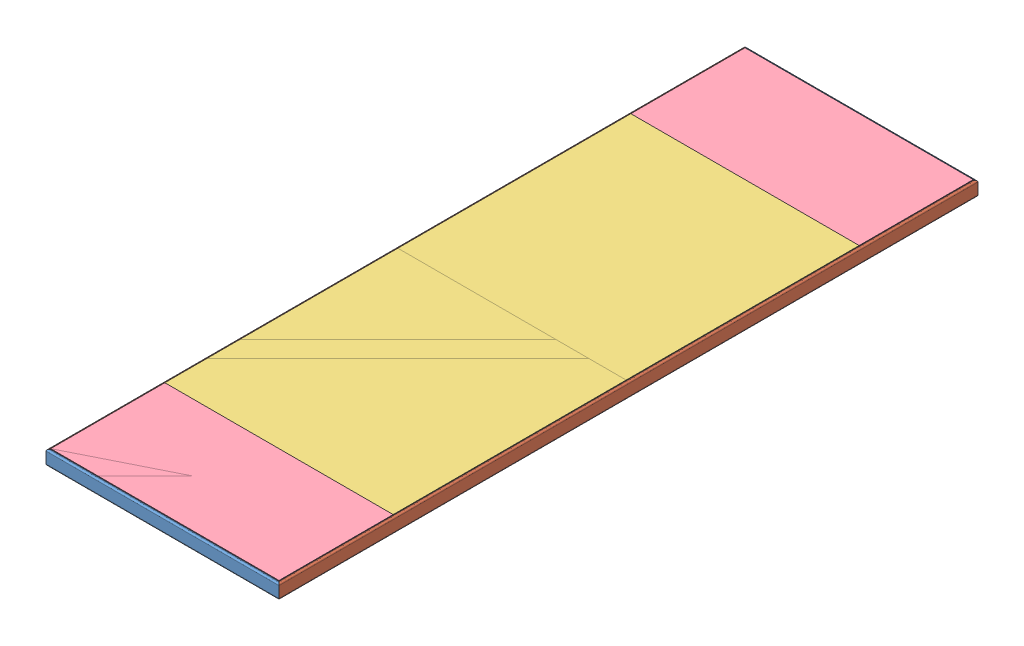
SolidWorks assembly Rahmen u Blech (RaBl).SLDASM, configuration Standard (file format 10000). Lengths in mm.
Overall size (1000 63 3000).
10 component instances, 4 part files, 14 mates.
Components (placement in the parent):
- RaBl_Rohr A-1: RaBl_Rohr A.SLDPRT [060,0 x 060,0 x 03,0] at (0 0 -1500) x (0 0 1) z (-1 0 0) size (60 60 1000)
- RaBl_Rohr B-1: RaBl_Rohr B.SLDPRT [060,0 x 060,0 x 03,0] at (-500 0 0) size (60 60 3000)
- RaBl_Rohr B-2: RaBl_Rohr B.SLDPRT [060,0 x 060,0 x 03,0] at (500 0 0) x (-1 0 0) z (0 0 -1) size (60 60 3000)
- RaBl_Rohr A-2: RaBl_Rohr A.SLDPRT [060,0 x 060,0 x 03,0] at (0 0 1500) x (0 0 -1) z (1 0 0) size (60 60 1000)
- RaBl_Blech A-1: RaBl_Blech A.SLDPRT [03,0] at origin size (980 3 1000) (hidden)
- RaBl_Blech B-1: RaBl_Blech B.SLDPRT [03,0] at (0 0 1490) size (980 3 490) (hidden)
- RaBl_Blech A-2: RaBl_Blech A.SLDPRT [03,0] at (0 0 -1000) size (980 3 1000)
- RaBl_Blech B-2: RaBl_Blech B.SLDPRT [03,0] at (0 0 1490) size (980 3 490)
- RaBl_Blech A-3: RaBl_Blech A.SLDPRT [03,0] at origin size (980 3 1000)
- RaBl_Blech B-3: RaBl_Blech B.SLDPRT [03,0] at (0 0 -1490) x (-1 0 0) z (0 0 -1) size (980 3 490)
Mates (geometry in assembly coordinates):
- Z zu Lin_01: coincident anti-aligned: line of RaBl_Rohr A-1 through (13.137 0 -1500) axis (-1 0 0); line of assembly
- X zu Lin_01: coincident aligned: line of RaBl_Rohr A-1 through (0 0 -1511) axis (0 0 1); line of assembly
- Z zu Lin_02: coincident aligned: line of RaBl_Rohr B-1 through (-500 0 -13.137) axis (0 0 1); line of assembly
- X zu Lin_02: coincident aligned: line of RaBl_Rohr B-1 through (22 -511 0) axis (0 1 0); line of assembly
- Z zu Lin_03: coincident anti-aligned: line of ? through (0 0 -44.7194) axis (0 0 1)
- X zu Lin_03: coincident aligned: line of ? through (160.5945 -34.4128 0) axis (0 1 0)
- Deckungsgleich1: coincident anti-aligned: line of ? through (0 0 1445.2806) axis (0 0 1)
- Deckungsgleich2: coincident aligned: line of ? through (-34.4128 0 1490) axis (1 0 0)
- Deckungsgleich3: coincident anti-aligned: line of RaBl_Blech A-2 through (0 0 -1044.7194) axis (0 0 1); line of assembly
- Deckungsgleich4: coincident aligned: line of RaBl_Blech A-2 through (-34.4128 0 -1000) axis (1 0 0); line of assembly
- Deckungsgleich5: coincident anti-aligned: line of ? through (0 0 1445.2806) axis (0 0 1)
- Deckungsgleich6: coincident aligned: line of ? through (-34.4128 0 1490) axis (1 0 0)
- Deckungsgleich7: coincident aligned: line of RaBl_Blech B-3 through (0 0 -1445.2806) axis (0 0 -1); line of assembly
- Deckungsgleich8: coincident anti-aligned: line of RaBl_Blech B-3 through (34.4128 0 -1490) axis (-1 0 0); line of assembly
